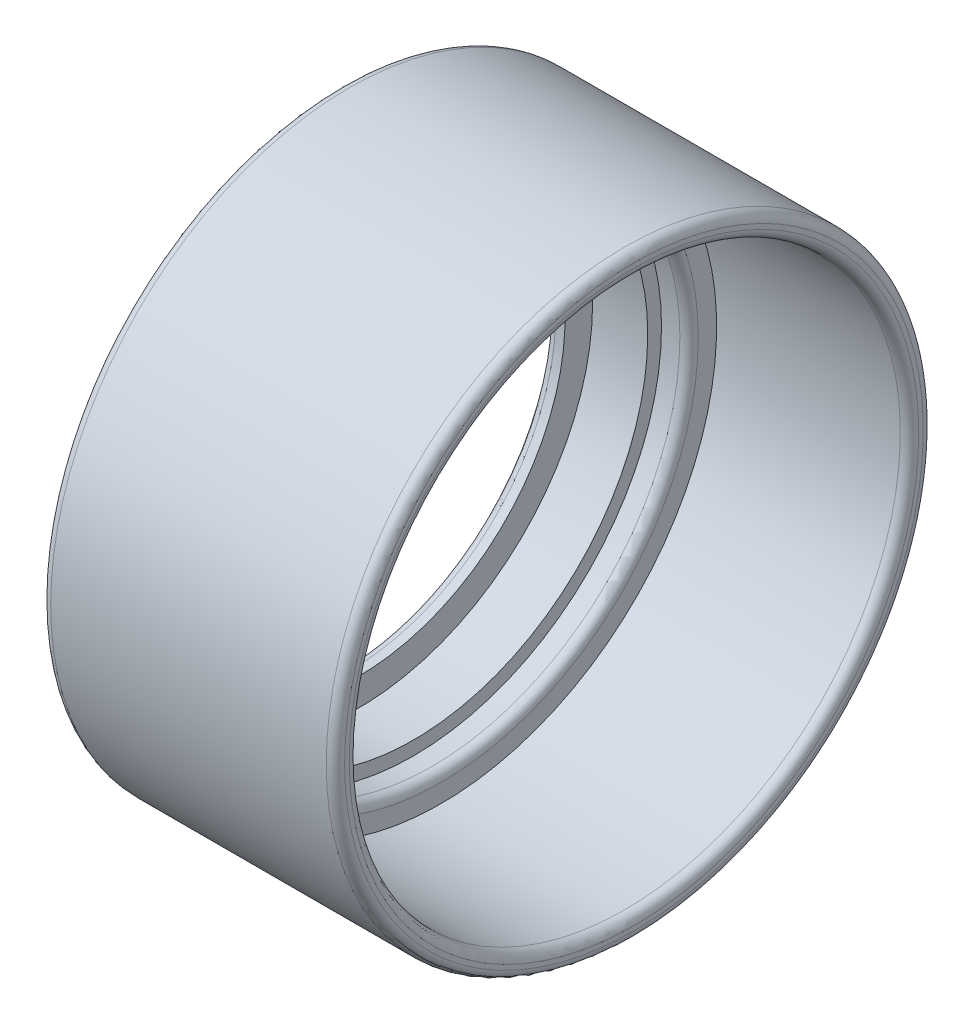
ISO-10303-21;
HEADER;
FILE_DESCRIPTION(('STEP AP214'),'2;1');
FILE_NAME('part.step','',(''),(''),'','','');
FILE_SCHEMA(('AUTOMOTIVE_DESIGN { 1 0 10303 214 1 1 1 1 }'));
ENDSEC;
DATA;
#1=APPLICATION_CONTEXT('core data for automotive mechanical design processes');
#2=APPLICATION_PROTOCOL_DEFINITION('international standard','automotive_design',2000,#1);
#3=PRODUCT_CONTEXT('',#1,'mechanical');
#4=PRODUCT('Part','Part','',(#3));
#5=PRODUCT_RELATED_PRODUCT_CATEGORY('part','',(#4));
#6=PRODUCT_DEFINITION_FORMATION('','',#4);
#7=PRODUCT_DEFINITION_CONTEXT('part definition',#1,'design');
#8=PRODUCT_DEFINITION('design','',#6,#7);
#9=PRODUCT_DEFINITION_SHAPE('','',#8);
#10=(LENGTH_UNIT() NAMED_UNIT(*) SI_UNIT(.MILLI.,.METRE.));
#11=(NAMED_UNIT(*) PLANE_ANGLE_UNIT() SI_UNIT($,.RADIAN.));
#12=(NAMED_UNIT(*) SI_UNIT($,.STERADIAN.) SOLID_ANGLE_UNIT());
#13=UNCERTAINTY_MEASURE_WITH_UNIT(LENGTH_MEASURE(1.E-05),#10,'distance_accuracy_value','');
#14=(GEOMETRIC_REPRESENTATION_CONTEXT(3) GLOBAL_UNCERTAINTY_ASSIGNED_CONTEXT((#13)) GLOBAL_UNIT_ASSIGNED_CONTEXT((#10,
#11,#12)) REPRESENTATION_CONTEXT('',''));
#15=CARTESIAN_POINT('',(0.,0.,0.));
#16=DIRECTION('',(0.,0.,1.));
#17=DIRECTION('',(1.,0.,0.));
#18=AXIS2_PLACEMENT_3D('',#15,#16,#17);
#19=CARTESIAN_POINT('',(2.,22.5,0.));
#20=DIRECTION('',(-1.,0.,0.));
#21=DIRECTION('',(0.,0.,1.));
#22=AXIS2_PLACEMENT_3D('',#19,#20,#21);
#23=PLANE('',#22);
#24=CARTESIAN_POINT('',(2.,0.,0.));
#25=DIRECTION('',(-1.,0.,0.));
#26=DIRECTION('',(0.,0.,1.));
#27=AXIS2_PLACEMENT_3D('',#24,#25,#26);
#28=CIRCLE('',#27,25.5);
#29=CARTESIAN_POINT('',(2.,0.,25.5));
#30=VERTEX_POINT('',#29);
#31=EDGE_CURVE('E10',#30,#30,#28,.T.);
#32=ORIENTED_EDGE('',*,*,#31,.F.);
#33=EDGE_LOOP('',(#32));
#34=FACE_BOUND('',#33,.T.);
#35=CARTESIAN_POINT('',(2.,0.,0.));
#36=DIRECTION('',(-1.,0.,0.));
#37=DIRECTION('',(0.,0.,1.));
#38=AXIS2_PLACEMENT_3D('',#35,#36,#37);
#39=CIRCLE('',#38,22.5);
#40=CARTESIAN_POINT('',(2.,0.,22.5));
#41=VERTEX_POINT('',#40);
#42=EDGE_CURVE('E78',#41,#41,#39,.T.);
#43=ORIENTED_EDGE('',*,*,#42,.T.);
#44=EDGE_LOOP('',(#43));
#45=FACE_BOUND('',#44,.T.);
#46=ADVANCED_FACE('F29',(#34,#45),#23,.F.);
#47=CARTESIAN_POINT('',(-93.9044609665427,0.,0.));
#48=DIRECTION('',(-1.,0.,0.));
#49=DIRECTION('',(0.,0.,1.));
#50=AXIS2_PLACEMENT_3D('',#47,#48,#49);
#51=CYLINDRICAL_SURFACE('',#50,25.5);
#52=CARTESIAN_POINT('',(7.99999999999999,0.,0.));
#53=DIRECTION('',(-1.,0.,0.));
#54=DIRECTION('',(0.,0.,1.));
#55=AXIS2_PLACEMENT_3D('',#52,#53,#54);
#56=CIRCLE('',#55,25.5);
#57=CARTESIAN_POINT('',(7.99999999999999,0.,25.5));
#58=VERTEX_POINT('',#57);
#59=EDGE_CURVE('E35',#58,#58,#56,.T.);
#60=ORIENTED_EDGE('',*,*,#59,.F.);
#61=EDGE_LOOP('',(#60));
#62=FACE_BOUND('',#61,.T.);
#63=ORIENTED_EDGE('',*,*,#31,.T.);
#64=EDGE_LOOP('',(#63));
#65=FACE_BOUND('',#64,.T.);
#66=ADVANCED_FACE('F157',(#62,#65),#51,.F.);
#67=CARTESIAN_POINT('',(8.,25.5,0.));
#68=DIRECTION('',(-1.,0.,0.));
#69=DIRECTION('',(0.,0.,1.));
#70=AXIS2_PLACEMENT_3D('',#67,#68,#69);
#71=PLANE('',#70);
#72=CARTESIAN_POINT('',(7.99999999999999,0.,0.));
#73=DIRECTION('',(-1.,0.,0.));
#74=DIRECTION('',(0.,0.,1.));
#75=AXIS2_PLACEMENT_3D('',#72,#73,#74);
#76=CIRCLE('',#75,27.);
#77=CARTESIAN_POINT('',(7.99999999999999,0.,27.));
#78=VERTEX_POINT('',#77);
#79=EDGE_CURVE('E39',#78,#78,#76,.T.);
#80=ORIENTED_EDGE('',*,*,#79,.F.);
#81=EDGE_LOOP('',(#80));
#82=FACE_BOUND('',#81,.T.);
#83=ORIENTED_EDGE('',*,*,#59,.T.);
#84=EDGE_LOOP('',(#83));
#85=FACE_BOUND('',#84,.T.);
#86=ADVANCED_FACE('F152',(#82,#85),#71,.F.);
#87=CARTESIAN_POINT('',(-93.9044609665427,0.,0.));
#88=DIRECTION('',(-1.,0.,0.));
#89=DIRECTION('',(0.,0.,1.));
#90=AXIS2_PLACEMENT_3D('',#87,#88,#89);
#91=CYLINDRICAL_SURFACE('',#90,27.);
#92=CARTESIAN_POINT('',(9.99999999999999,0.,0.));
#93=DIRECTION('',(-1.,0.,0.));
#94=DIRECTION('',(0.,0.,1.));
#95=AXIS2_PLACEMENT_3D('',#92,#93,#94);
#96=CIRCLE('',#95,27.);
#97=CARTESIAN_POINT('',(9.99999999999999,0.,27.));
#98=VERTEX_POINT('',#97);
#99=EDGE_CURVE('E43',#98,#98,#96,.T.);
#100=ORIENTED_EDGE('',*,*,#99,.F.);
#101=EDGE_LOOP('',(#100));
#102=FACE_BOUND('',#101,.T.);
#103=ORIENTED_EDGE('',*,*,#79,.T.);
#104=EDGE_LOOP('',(#103));
#105=FACE_BOUND('',#104,.T.);
#106=ADVANCED_FACE('F146',(#102,#105),#91,.F.);
#107=CARTESIAN_POINT('',(10.,0.,0.));
#108=DIRECTION('',(-1.,0.,0.));
#109=DIRECTION('',(0.,0.,1.));
#110=AXIS2_PLACEMENT_3D('',#107,#108,#109);
#111=TOROIDAL_SURFACE('',#110,28.,1.);
#112=CARTESIAN_POINT('',(11.,0.,0.));
#113=DIRECTION('',(-1.,0.,0.));
#114=DIRECTION('',(0.,0.,1.));
#115=AXIS2_PLACEMENT_3D('',#112,#113,#114);
#116=CIRCLE('',#115,28.);
#117=CARTESIAN_POINT('',(11.,0.,28.));
#118=VERTEX_POINT('',#117);
#119=EDGE_CURVE('E48',#118,#118,#116,.T.);
#120=ORIENTED_EDGE('',*,*,#119,.F.);
#121=EDGE_LOOP('',(#120));
#122=FACE_BOUND('',#121,.T.);
#123=ORIENTED_EDGE('',*,*,#99,.T.);
#124=EDGE_LOOP('',(#123));
#125=FACE_BOUND('',#124,.T.);
#126=ADVANCED_FACE('F140',(#122,#125),#111,.T.);
#127=CARTESIAN_POINT('',(11.,28.,0.));
#128=DIRECTION('',(-1.,0.,0.));
#129=DIRECTION('',(0.,0.,1.));
#130=AXIS2_PLACEMENT_3D('',#127,#128,#129);
#131=PLANE('',#130);
#132=CARTESIAN_POINT('',(11.,0.,0.));
#133=DIRECTION('',(-1.,0.,0.));
#134=DIRECTION('',(0.,0.,1.));
#135=AXIS2_PLACEMENT_3D('',#132,#133,#134);
#136=CIRCLE('',#135,30.);
#137=CARTESIAN_POINT('',(11.,0.,30.));
#138=VERTEX_POINT('',#137);
#139=EDGE_CURVE('E51',#138,#138,#136,.T.);
#140=ORIENTED_EDGE('',*,*,#139,.F.);
#141=EDGE_LOOP('',(#140));
#142=FACE_BOUND('',#141,.T.);
#143=ORIENTED_EDGE('',*,*,#119,.T.);
#144=EDGE_LOOP('',(#143));
#145=FACE_BOUND('',#144,.T.);
#146=ADVANCED_FACE('F134',(#142,#145),#131,.F.);
#147=CARTESIAN_POINT('',(-93.9044609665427,0.,0.));
#148=DIRECTION('',(-1.,0.,0.));
#149=DIRECTION('',(0.,0.,1.));
#150=AXIS2_PLACEMENT_3D('',#147,#148,#149);
#151=CYLINDRICAL_SURFACE('',#150,30.);
#152=CARTESIAN_POINT('',(31.,0.,0.));
#153=DIRECTION('',(-1.,0.,0.));
#154=DIRECTION('',(0.,0.,1.));
#155=AXIS2_PLACEMENT_3D('',#152,#153,#154);
#156=CIRCLE('',#155,30.);
#157=CARTESIAN_POINT('',(31.,0.,30.));
#158=VERTEX_POINT('',#157);
#159=EDGE_CURVE('E54',#158,#158,#156,.T.);
#160=ORIENTED_EDGE('',*,*,#159,.F.);
#161=EDGE_LOOP('',(#160));
#162=FACE_BOUND('',#161,.T.);
#163=ORIENTED_EDGE('',*,*,#139,.T.);
#164=EDGE_LOOP('',(#163));
#165=FACE_BOUND('',#164,.T.);
#166=ADVANCED_FACE('F128',(#162,#165),#151,.F.);
#167=CARTESIAN_POINT('',(31.,0.,0.));
#168=DIRECTION('',(-1.,0.,0.));
#169=DIRECTION('',(0.,0.,1.));
#170=AXIS2_PLACEMENT_3D('',#167,#168,#169);
#171=TOROIDAL_SURFACE('',#170,31.,1.);
#172=CARTESIAN_POINT('',(32.,0.,0.));
#173=DIRECTION('',(-1.,0.,0.));
#174=DIRECTION('',(0.,0.,1.));
#175=AXIS2_PLACEMENT_3D('',#172,#173,#174);
#176=CIRCLE('',#175,31.);
#177=CARTESIAN_POINT('',(32.,0.,31.));
#178=VERTEX_POINT('',#177);
#179=EDGE_CURVE('E57',#178,#178,#176,.T.);
#180=ORIENTED_EDGE('',*,*,#179,.F.);
#181=EDGE_LOOP('',(#180));
#182=FACE_BOUND('',#181,.T.);
#183=ORIENTED_EDGE('',*,*,#159,.T.);
#184=EDGE_LOOP('',(#183));
#185=FACE_BOUND('',#184,.T.);
#186=ADVANCED_FACE('F122',(#182,#185),#171,.T.);
#187=CARTESIAN_POINT('',(32.,31.,0.));
#188=DIRECTION('',(-1.,0.,0.));
#189=DIRECTION('',(0.,0.,1.));
#190=AXIS2_PLACEMENT_3D('',#187,#188,#189);
#191=PLANE('',#190);
#192=CARTESIAN_POINT('',(32.,0.,0.));
#193=DIRECTION('',(-1.,0.,0.));
#194=DIRECTION('',(0.,0.,1.));
#195=AXIS2_PLACEMENT_3D('',#192,#193,#194);
#196=CIRCLE('',#195,31.5);
#197=CARTESIAN_POINT('',(32.,0.,31.5));
#198=VERTEX_POINT('',#197);
#199=EDGE_CURVE('E60',#198,#198,#196,.T.);
#200=ORIENTED_EDGE('',*,*,#199,.F.);
#201=EDGE_LOOP('',(#200));
#202=FACE_BOUND('',#201,.T.);
#203=ORIENTED_EDGE('',*,*,#179,.T.);
#204=EDGE_LOOP('',(#203));
#205=FACE_BOUND('',#204,.T.);
#206=ADVANCED_FACE('F116',(#202,#205),#191,.F.);
#207=CARTESIAN_POINT('',(31.,0.,0.));
#208=DIRECTION('',(-1.,0.,0.));
#209=DIRECTION('',(0.,0.,1.));
#210=AXIS2_PLACEMENT_3D('',#207,#208,#209);
#211=TOROIDAL_SURFACE('',#210,31.5,1.);
#212=CARTESIAN_POINT('',(31.,0.,0.));
#213=DIRECTION('',(-1.,0.,0.));
#214=DIRECTION('',(0.,0.,1.));
#215=AXIS2_PLACEMENT_3D('',#212,#213,#214);
#216=CIRCLE('',#215,32.5);
#217=CARTESIAN_POINT('',(31.,0.,32.5));
#218=VERTEX_POINT('',#217);
#219=EDGE_CURVE('E63',#218,#218,#216,.T.);
#220=ORIENTED_EDGE('',*,*,#219,.F.);
#221=EDGE_LOOP('',(#220));
#222=FACE_BOUND('',#221,.T.);
#223=ORIENTED_EDGE('',*,*,#199,.T.);
#224=EDGE_LOOP('',(#223));
#225=FACE_BOUND('',#224,.T.);
#226=ADVANCED_FACE('F110',(#222,#225),#211,.T.);
#227=CARTESIAN_POINT('',(-93.9044609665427,0.,0.));
#228=DIRECTION('',(-1.,0.,0.));
#229=DIRECTION('',(0.,0.,1.));
#230=AXIS2_PLACEMENT_3D('',#227,#228,#229);
#231=CYLINDRICAL_SURFACE('',#230,32.5);
#232=CARTESIAN_POINT('',(1.,0.,0.));
#233=DIRECTION('',(-1.,0.,0.));
#234=DIRECTION('',(0.,0.,1.));
#235=AXIS2_PLACEMENT_3D('',#232,#233,#234);
#236=CIRCLE('',#235,32.5);
#237=CARTESIAN_POINT('',(1.,0.,32.5));
#238=VERTEX_POINT('',#237);
#239=EDGE_CURVE('E66',#238,#238,#236,.T.);
#240=ORIENTED_EDGE('',*,*,#239,.F.);
#241=EDGE_LOOP('',(#240));
#242=FACE_BOUND('',#241,.T.);
#243=ORIENTED_EDGE('',*,*,#219,.T.);
#244=EDGE_LOOP('',(#243));
#245=FACE_BOUND('',#244,.T.);
#246=ADVANCED_FACE('F104',(#242,#245),#231,.T.);
#247=CARTESIAN_POINT('',(1.,0.,0.));
#248=DIRECTION('',(-1.,0.,0.));
#249=DIRECTION('',(0.,0.,1.));
#250=AXIS2_PLACEMENT_3D('',#247,#248,#249);
#251=TOROIDAL_SURFACE('',#250,31.5,1.);
#252=CARTESIAN_POINT('',(0.,0.,0.));
#253=DIRECTION('',(-1.,0.,0.));
#254=DIRECTION('',(0.,0.,1.));
#255=AXIS2_PLACEMENT_3D('',#252,#253,#254);
#256=CIRCLE('',#255,31.5);
#257=CARTESIAN_POINT('',(0.,0.,31.5));
#258=VERTEX_POINT('',#257);
#259=EDGE_CURVE('E69',#258,#258,#256,.T.);
#260=ORIENTED_EDGE('',*,*,#259,.F.);
#261=EDGE_LOOP('',(#260));
#262=FACE_BOUND('',#261,.T.);
#263=ORIENTED_EDGE('',*,*,#239,.T.);
#264=EDGE_LOOP('',(#263));
#265=FACE_BOUND('',#264,.T.);
#266=ADVANCED_FACE('F98',(#262,#265),#251,.T.);
#267=CARTESIAN_POINT('',(0.,23.5,0.));
#268=DIRECTION('',(1.,0.,0.));
#269=DIRECTION('',(0.,0.,-1.));
#270=AXIS2_PLACEMENT_3D('',#267,#268,#269);
#271=PLANE('',#270);
#272=CARTESIAN_POINT('',(0.,0.,0.));
#273=DIRECTION('',(-1.,0.,0.));
#274=DIRECTION('',(0.,0.,1.));
#275=AXIS2_PLACEMENT_3D('',#272,#273,#274);
#276=CIRCLE('',#275,23.5);
#277=CARTESIAN_POINT('',(0.,0.,23.5));
#278=VERTEX_POINT('',#277);
#279=EDGE_CURVE('E72',#278,#278,#276,.T.);
#280=ORIENTED_EDGE('',*,*,#279,.F.);
#281=EDGE_LOOP('',(#280));
#282=FACE_BOUND('',#281,.T.);
#283=ORIENTED_EDGE('',*,*,#259,.T.);
#284=EDGE_LOOP('',(#283));
#285=FACE_BOUND('',#284,.T.);
#286=ADVANCED_FACE('F92',(#282,#285),#271,.F.);
#287=CARTESIAN_POINT('',(1.,0.,0.));
#288=DIRECTION('',(-1.,0.,0.));
#289=DIRECTION('',(0.,0.,1.));
#290=AXIS2_PLACEMENT_3D('',#287,#288,#289);
#291=TOROIDAL_SURFACE('',#290,23.5,1.);
#292=CARTESIAN_POINT('',(1.,0.,0.));
#293=DIRECTION('',(-1.,0.,0.));
#294=DIRECTION('',(0.,0.,1.));
#295=AXIS2_PLACEMENT_3D('',#292,#293,#294);
#296=CIRCLE('',#295,22.5);
#297=CARTESIAN_POINT('',(1.,0.,22.5));
#298=VERTEX_POINT('',#297);
#299=EDGE_CURVE('E75',#298,#298,#296,.T.);
#300=ORIENTED_EDGE('',*,*,#299,.F.);
#301=EDGE_LOOP('',(#300));
#302=FACE_BOUND('',#301,.T.);
#303=ORIENTED_EDGE('',*,*,#279,.T.);
#304=EDGE_LOOP('',(#303));
#305=FACE_BOUND('',#304,.T.);
#306=ADVANCED_FACE('F86',(#302,#305),#291,.T.);
#307=CARTESIAN_POINT('',(-93.9044609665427,0.,0.));
#308=DIRECTION('',(-1.,0.,0.));
#309=DIRECTION('',(0.,0.,1.));
#310=AXIS2_PLACEMENT_3D('',#307,#308,#309);
#311=CYLINDRICAL_SURFACE('',#310,22.5);
#312=ORIENTED_EDGE('',*,*,#42,.F.);
#313=EDGE_LOOP('',(#312));
#314=FACE_BOUND('',#313,.T.);
#315=ORIENTED_EDGE('',*,*,#299,.T.);
#316=EDGE_LOOP('',(#315));
#317=FACE_BOUND('',#316,.T.);
#318=ADVANCED_FACE('F83',(#314,#317),#311,.F.);
#319=CLOSED_SHELL('',(#46,#66,#86,#106,#126,#146,#166,#186,#206,#226,#246,#266,#286,#306,#318));
#320=MANIFOLD_SOLID_BREP('B2',#319);
#321=ADVANCED_BREP_SHAPE_REPRESENTATION('',(#18,#320),#14);
#322=SHAPE_DEFINITION_REPRESENTATION(#9,#321);
ENDSEC;
END-ISO-10303-21;
